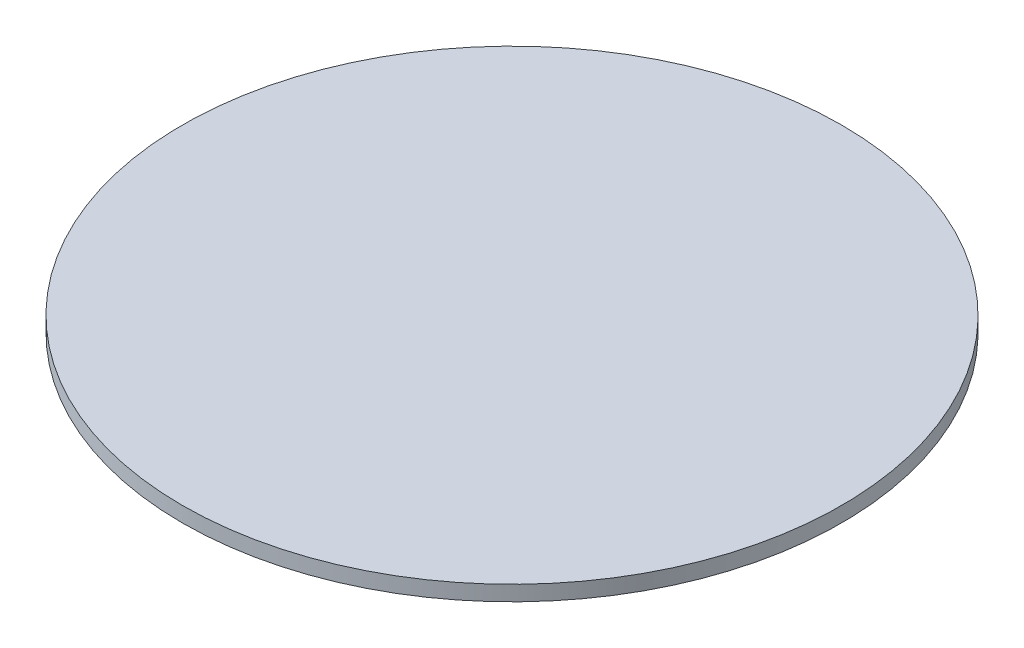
ISO-10303-21;
HEADER;
FILE_DESCRIPTION(('STEP AP214'),'2;1');
FILE_NAME('part.step','',(''),(''),'','','');
FILE_SCHEMA(('AUTOMOTIVE_DESIGN { 1 0 10303 214 1 1 1 1 }'));
ENDSEC;
DATA;
#1=APPLICATION_CONTEXT('core data for automotive mechanical design processes');
#2=APPLICATION_PROTOCOL_DEFINITION('international standard','automotive_design',2000,#1);
#3=PRODUCT_CONTEXT('',#1,'mechanical');
#4=PRODUCT('Part','Part','',(#3));
#5=PRODUCT_RELATED_PRODUCT_CATEGORY('part','',(#4));
#6=PRODUCT_DEFINITION_FORMATION('','',#4);
#7=PRODUCT_DEFINITION_CONTEXT('part definition',#1,'design');
#8=PRODUCT_DEFINITION('design','',#6,#7);
#9=PRODUCT_DEFINITION_SHAPE('','',#8);
#10=(LENGTH_UNIT() NAMED_UNIT(*) SI_UNIT(.MILLI.,.METRE.));
#11=(NAMED_UNIT(*) PLANE_ANGLE_UNIT() SI_UNIT($,.RADIAN.));
#12=(NAMED_UNIT(*) SI_UNIT($,.STERADIAN.) SOLID_ANGLE_UNIT());
#13=UNCERTAINTY_MEASURE_WITH_UNIT(LENGTH_MEASURE(1.E-05),#10,'distance_accuracy_value','');
#14=(GEOMETRIC_REPRESENTATION_CONTEXT(3) GLOBAL_UNCERTAINTY_ASSIGNED_CONTEXT((#13)) GLOBAL_UNIT_ASSIGNED_CONTEXT((#10,
#11,#12)) REPRESENTATION_CONTEXT('',''));
#15=CARTESIAN_POINT('',(0.,0.,0.));
#16=DIRECTION('',(0.,0.,1.));
#17=DIRECTION('',(1.,0.,0.));
#18=AXIS2_PLACEMENT_3D('',#15,#16,#17);
#19=CARTESIAN_POINT('',(0.,0.3,0.));
#20=DIRECTION('',(0.,-1.,0.));
#21=DIRECTION('',(0.,0.,-1.));
#22=AXIS2_PLACEMENT_3D('',#19,#20,#21);
#23=CYLINDRICAL_SURFACE('',#22,6.5);
#24=CARTESIAN_POINT('',(0.,0.3,0.));
#25=DIRECTION('',(0.,1.,0.));
#26=DIRECTION('',(0.,0.,1.));
#27=AXIS2_PLACEMENT_3D('',#24,#25,#26);
#28=CIRCLE('',#27,6.5);
#29=CARTESIAN_POINT('',(0.,0.3,6.5));
#30=VERTEX_POINT('',#29);
#31=EDGE_CURVE('E10',#30,#30,#28,.T.);
#32=ORIENTED_EDGE('',*,*,#31,.F.);
#33=EDGE_LOOP('',(#32));
#34=FACE_BOUND('',#33,.T.);
#35=CARTESIAN_POINT('',(0.,0.,0.));
#36=DIRECTION('',(0.,1.,0.));
#37=DIRECTION('',(0.,0.,1.));
#38=AXIS2_PLACEMENT_3D('',#35,#36,#37);
#39=CIRCLE('',#38,6.5);
#40=CARTESIAN_POINT('',(0.,0.,6.5));
#41=VERTEX_POINT('',#40);
#42=EDGE_CURVE('E34',#41,#41,#39,.T.);
#43=ORIENTED_EDGE('',*,*,#42,.T.);
#44=EDGE_LOOP('',(#43));
#45=FACE_BOUND('',#44,.T.);
#46=ADVANCED_FACE('F31',(#34,#45),#23,.T.);
#47=CARTESIAN_POINT('',(0.,0.3,0.));
#48=DIRECTION('',(0.,1.,0.));
#49=DIRECTION('',(0.,0.,1.));
#50=AXIS2_PLACEMENT_3D('',#47,#48,#49);
#51=PLANE('',#50);
#52=ORIENTED_EDGE('',*,*,#31,.T.);
#53=EDGE_LOOP('',(#52));
#54=FACE_BOUND('',#53,.T.);
#55=ADVANCED_FACE('F46',(#54),#51,.T.);
#56=CARTESIAN_POINT('',(0.,0.,0.));
#57=DIRECTION('',(0.,1.,0.));
#58=DIRECTION('',(0.,0.,1.));
#59=AXIS2_PLACEMENT_3D('',#56,#57,#58);
#60=PLANE('',#59);
#61=ORIENTED_EDGE('',*,*,#42,.F.);
#62=EDGE_LOOP('',(#61));
#63=FACE_BOUND('',#62,.T.);
#64=ADVANCED_FACE('F44',(#63),#60,.F.);
#65=CLOSED_SHELL('',(#46,#55,#64));
#66=MANIFOLD_SOLID_BREP('B2',#65);
#67=ADVANCED_BREP_SHAPE_REPRESENTATION('',(#18,#66),#14);
#68=SHAPE_DEFINITION_REPRESENTATION(#9,#67);
ENDSEC;
END-ISO-10303-21;
